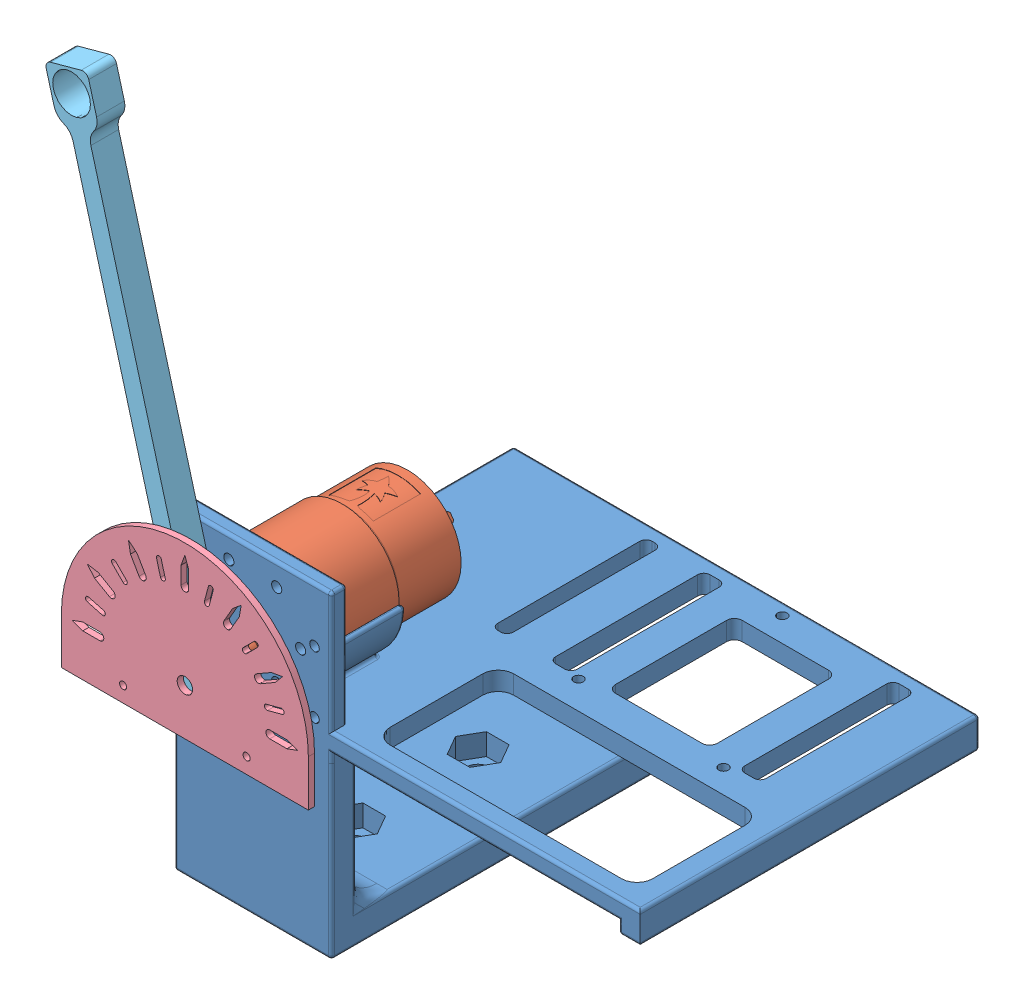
SolidWorks assembly 37 gear motor setup.SLDASM, configuration Pendulum Up (file format 14000). Lengths in mm.
Overall size (176.69 229.55 132).
8 component instances, 5 part files, 18 mates.
Components (placement in the parent):
- 37d Gear Base-1: 37d Gear Base.SLDPRT [37d gear motor] at (-34.4312 28.6944 178.1544) x (0 0 -1) z (1 0 0)
- 37d-gearmotor-100rpm-1: 37d-gearmotor-100rpm.SLDPRT [Varsayılan] at (-28.8562 111.1944 149.2294)
- tops-1: tops.SLDPRT [Default] at (-8.9312 71.2644 145.1544)
- Angle_guide-1: Angle_guide.SLDPRT [Default] at (-8.9312 104.1944 198.1544) (suppressed, hidden)
- pendulum_arm_157mm_old-1: pendulum_arm_157mm_old.SLDPRT [Default] at (-8.9312 104.1944 188.1544) (suppressed, hidden)
- Angle_guide-2: Angle_guide.SLDPRT [Default] at (-8.9312 104.1944 198.1544) x (-1 0 0) z (0 0 1)
- pendulum_arm_157mm_old-2: pendulum_arm_157mm_old.SLDPRT [Default] at (-8.9312 104.1944 188.1544) x (-0.96435 -0.264631 0) z (0 0 1)
- tops-2: tops.SLDPRT [Default] at (-8.9312 71.2644 105.1544)
Mates (geometry in assembly coordinates):
- Concentric1: concentric anti-aligned: cylinder of 37d Gear Base-1 through (-8.9312 104.1944 68.1544) axis (0 0 1) radius 6.4; cylinder of 37d-gearmotor-100rpm-1 through (-8.9312 104.1944 179.6544) axis (0 0 -1) radius 6
- Coincident1: coincident anti-aligned: plane of 37d Gear Base-1 through (-34.4312 131.6944 173.1544) normal (0 0 -1); plane of 37d-gearmotor-100rpm-1 through (-8.9312 111.1944 173.1544) normal (0 0 1)
- Concentric2: concentric anti-aligned: cylinder of 37d Gear Base-1 through (-8.9312 28.6944 145.1544) axis (0 1 0) radius 4.064; cylinder of tops-1 through (-8.9312 77.6144 145.1544) axis (0 -1 0) radius 3.937
- Coincident2: coincident anti-aligned: plane of 37d Gear Base-1 through (16.5688 82.6944 178.1544) normal (0 -1 0); plane of tops-1 through (-8.9312 82.6944 145.1544) normal (0 1 0)
- Concentric3: concentric aligned: cylinder of 37d-gearmotor-100rpm-1 through (-8.9312 104.1944 195.1544) axis (0 0 -1) radius 3; cylinder of pendulum_arm_157mm_old-1 through (-8.9312 104.1944 197.1544) axis (0 0 -1) radius 3.3
- Coincident4: coincident anti-aligned: plane of 37d-gearmotor-100rpm-1 through (-8.9312 104.1944 195.1544) normal (0 0 1); plane of pendulum_arm_157mm_old-1 through (-8.9312 104.1944 195.1544) normal (0 0 -1)
- Parallel2: parallel aligned: line of 37d-gearmotor-100rpm-1 through (-7.1312 106.5944 195.1544) axis (-1 0 0); line of pendulum_arm_157mm_old-1 through (-7.0683 106.9183 195.1544) axis (-1 0 0)
- Concentric4: concentric aligned: cylinder of 37d Gear Base-1 through (-28.9312 114.1944 168.7703) axis (0 0 1) radius 1.55; cylinder of Angle_guide-1 through (-28.9312 114.1944 194.9017) axis (0 0 1) radius 1.15
- Concentric5: concentric aligned: cylinder of 37d Gear Base-1 through (11.0688 114.1944 168.7703) axis (0 0 1) radius 1.55; cylinder of Angle_guide-1 through (11.0688 114.1944 194.9017) axis (0 0 1) radius 1.15
- Distance1: distance = 20 mm anti-aligned: plane of 37d Gear Base-1 through (16.5688 28.6944 178.1544) normal (0 0 1); plane of Angle_guide-1 through (-8.9312 104.1944 198.1544) normal (0 0 -1)
- Parallel6: parallel aligned: plane of 37d Gear Base-1 through (16.5688 92.6944 178.1544) normal (0 1 0); plane of 37d-gearmotor-100rpm-1 through (-8.9312 106.5944 183.1544) normal (0 1 0)
- Concentric6: concentric aligned: cylinder of 37d Gear Base-1 through (11.0688 94.1944 168.7703) axis (0 0 1) radius 1.55; cylinder of Angle_guide-2 through (11.0688 94.1944 194.9017) axis (0 0 1) radius 1.15
- Concentric7: concentric aligned: cylinder of 37d Gear Base-1 through (-28.9312 94.1944 168.7703) axis (0 0 1) radius 1.55; cylinder of Angle_guide-2 through (-28.9312 94.1944 194.9017) axis (0 0 1) radius 1.15
- Distance2: distance = 20 mm anti-aligned: plane of Angle_guide-2 through (-8.9312 104.1944 198.1544) normal (0 0 -1); plane of 37d Gear Base-1 through (16.5688 28.6944 178.1544) normal (0 0 1)
- Concentric8: concentric aligned: cylinder of 37d-gearmotor-100rpm-1 through (-8.9312 104.1944 195.1544) axis (0 0 -1) radius 3; cylinder of pendulum_arm_157mm_old-2 through (-8.9312 104.1944 197.1544) axis (0 0 -1) radius 3.3
- Coincident6: coincident anti-aligned: plane of 37d-gearmotor-100rpm-1 through (-8.9312 104.1944 195.1544) normal (0 0 1); plane of pendulum_arm_157mm_old-2 through (-8.9312 104.1944 195.1544) normal (0 0 -1)
- Concentric9: concentric anti-aligned: cylinder of 37d Gear Base-1 through (-8.9312 28.6944 105.1544) axis (0 1 0) radius 4.064; cylinder of tops-2 through (-8.9312 77.6144 105.1544) axis (0 -1 0) radius 3.937
- Coincident7: coincident anti-aligned: plane of 37d Gear Base-1 through (16.5688 82.6944 178.1544) normal (0 -1 0); plane of tops-2 through (-8.9312 82.6944 105.1544) normal (0 1 0)
